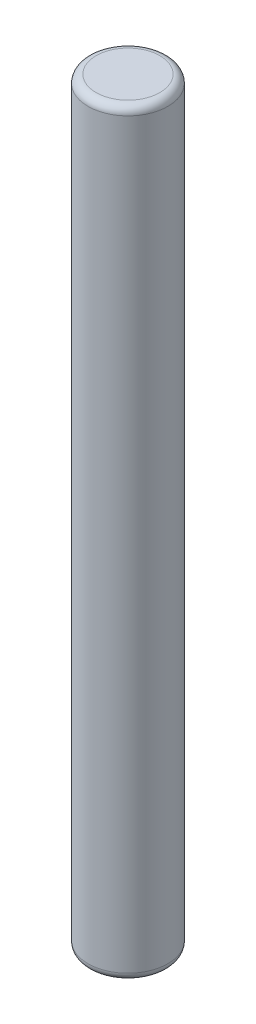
ISO-10303-21;
HEADER;
FILE_DESCRIPTION(('STEP AP214'),'2;1');
FILE_NAME('part.step','',(''),(''),'','','');
FILE_SCHEMA(('AUTOMOTIVE_DESIGN { 1 0 10303 214 1 1 1 1 }'));
ENDSEC;
DATA;
#1=APPLICATION_CONTEXT('core data for automotive mechanical design processes');
#2=APPLICATION_PROTOCOL_DEFINITION('international standard','automotive_design',2000,#1);
#3=PRODUCT_CONTEXT('',#1,'mechanical');
#4=PRODUCT('Part','Part','',(#3));
#5=PRODUCT_RELATED_PRODUCT_CATEGORY('part','',(#4));
#6=PRODUCT_DEFINITION_FORMATION('','',#4);
#7=PRODUCT_DEFINITION_CONTEXT('part definition',#1,'design');
#8=PRODUCT_DEFINITION('design','',#6,#7);
#9=PRODUCT_DEFINITION_SHAPE('','',#8);
#10=(LENGTH_UNIT() NAMED_UNIT(*) SI_UNIT(.MILLI.,.METRE.));
#11=(NAMED_UNIT(*) PLANE_ANGLE_UNIT() SI_UNIT($,.RADIAN.));
#12=(NAMED_UNIT(*) SI_UNIT($,.STERADIAN.) SOLID_ANGLE_UNIT());
#13=UNCERTAINTY_MEASURE_WITH_UNIT(LENGTH_MEASURE(1.E-05),#10,'distance_accuracy_value','');
#14=(GEOMETRIC_REPRESENTATION_CONTEXT(3) GLOBAL_UNCERTAINTY_ASSIGNED_CONTEXT((#13)) GLOBAL_UNIT_ASSIGNED_CONTEXT((#10,
#11,#12)) REPRESENTATION_CONTEXT('',''));
#15=CARTESIAN_POINT('',(0.,0.,0.));
#16=DIRECTION('',(0.,0.,1.));
#17=DIRECTION('',(1.,0.,0.));
#18=AXIS2_PLACEMENT_3D('',#15,#16,#17);
#19=CARTESIAN_POINT('',(0.,47.5,0.));
#20=DIRECTION('',(0.,-1.,0.));
#21=DIRECTION('',(0.,0.,-1.));
#22=AXIS2_PLACEMENT_3D('',#19,#20,#21);
#23=CYLINDRICAL_SURFACE('',#22,2.5);
#24=CARTESIAN_POINT('',(0.,0.5,0.));
#25=DIRECTION('',(0.,1.,0.));
#26=DIRECTION('',(0.,0.,1.));
#27=AXIS2_PLACEMENT_3D('',#24,#25,#26);
#28=CIRCLE('',#27,2.5);
#29=CARTESIAN_POINT('',(0.,0.5,2.5));
#30=VERTEX_POINT('',#29);
#31=EDGE_CURVE('E41',#30,#30,#28,.T.);
#32=ORIENTED_EDGE('',*,*,#31,.T.);
#33=EDGE_LOOP('',(#32));
#34=FACE_BOUND('',#33,.T.);
#35=CARTESIAN_POINT('',(0.,47.,0.));
#36=DIRECTION('',(0.,1.,0.));
#37=DIRECTION('',(0.,0.,1.));
#38=AXIS2_PLACEMENT_3D('',#35,#36,#37);
#39=CIRCLE('',#38,2.5);
#40=CARTESIAN_POINT('',(0.,47.,2.5));
#41=VERTEX_POINT('',#40);
#42=EDGE_CURVE('E45',#41,#41,#39,.F.);
#43=ORIENTED_EDGE('',*,*,#42,.T.);
#44=EDGE_LOOP('',(#43));
#45=FACE_BOUND('',#44,.T.);
#46=ADVANCED_FACE('F30',(#34,#45),#23,.T.);
#47=CARTESIAN_POINT('',(0.,47.5,0.));
#48=DIRECTION('',(0.,1.,0.));
#49=DIRECTION('',(0.,0.,1.));
#50=AXIS2_PLACEMENT_3D('',#47,#48,#49);
#51=PLANE('',#50);
#52=CARTESIAN_POINT('',(0.,47.5,0.));
#53=DIRECTION('',(0.,1.,0.));
#54=DIRECTION('',(0.,0.,1.));
#55=AXIS2_PLACEMENT_3D('',#52,#53,#54);
#56=CIRCLE('',#55,2.);
#57=CARTESIAN_POINT('',(0.,47.5,2.));
#58=VERTEX_POINT('',#57);
#59=EDGE_CURVE('E10',#58,#58,#56,.T.);
#60=ORIENTED_EDGE('',*,*,#59,.T.);
#61=EDGE_LOOP('',(#60));
#62=FACE_BOUND('',#61,.T.);
#63=ADVANCED_FACE('F61',(#62),#51,.T.);
#64=CARTESIAN_POINT('',(0.,0.,0.));
#65=DIRECTION('',(0.,1.,0.));
#66=DIRECTION('',(0.,0.,1.));
#67=AXIS2_PLACEMENT_3D('',#64,#65,#66);
#68=PLANE('',#67);
#69=CARTESIAN_POINT('',(0.,0.,0.));
#70=DIRECTION('',(0.,1.,0.));
#71=DIRECTION('',(0.,0.,1.));
#72=AXIS2_PLACEMENT_3D('',#69,#70,#71);
#73=CIRCLE('',#72,2.);
#74=CARTESIAN_POINT('',(0.,0.,2.));
#75=VERTEX_POINT('',#74);
#76=EDGE_CURVE('E37',#75,#75,#73,.F.);
#77=ORIENTED_EDGE('',*,*,#76,.T.);
#78=EDGE_LOOP('',(#77));
#79=FACE_BOUND('',#78,.T.);
#80=ADVANCED_FACE('F58',(#79),#68,.F.);
#81=CARTESIAN_POINT('',(0.,0.5,0.));
#82=DIRECTION('',(0.,1.,0.));
#83=DIRECTION('',(0.,0.,1.));
#84=AXIS2_PLACEMENT_3D('',#81,#82,#83);
#85=TOROIDAL_SURFACE('',#84,2.,0.5);
#86=ORIENTED_EDGE('',*,*,#76,.F.);
#87=EDGE_LOOP('',(#86));
#88=FACE_BOUND('',#87,.T.);
#89=ORIENTED_EDGE('',*,*,#31,.F.);
#90=EDGE_LOOP('',(#89));
#91=FACE_BOUND('',#90,.T.);
#92=ADVANCED_FACE('F54',(#88,#91),#85,.T.);
#93=CARTESIAN_POINT('',(0.,47.,0.));
#94=DIRECTION('',(0.,1.,0.));
#95=DIRECTION('',(0.,0.,1.));
#96=AXIS2_PLACEMENT_3D('',#93,#94,#95);
#97=TOROIDAL_SURFACE('',#96,2.,0.5);
#98=ORIENTED_EDGE('',*,*,#42,.F.);
#99=EDGE_LOOP('',(#98));
#100=FACE_BOUND('',#99,.T.);
#101=ORIENTED_EDGE('',*,*,#59,.F.);
#102=EDGE_LOOP('',(#101));
#103=FACE_BOUND('',#102,.T.);
#104=ADVANCED_FACE('F32',(#100,#103),#97,.T.);
#105=CLOSED_SHELL('',(#46,#63,#80,#92,#104));
#106=MANIFOLD_SOLID_BREP('B2',#105);
#107=ADVANCED_BREP_SHAPE_REPRESENTATION('',(#18,#106),#14);
#108=SHAPE_DEFINITION_REPRESENTATION(#9,#107);
ENDSEC;
END-ISO-10303-21;
